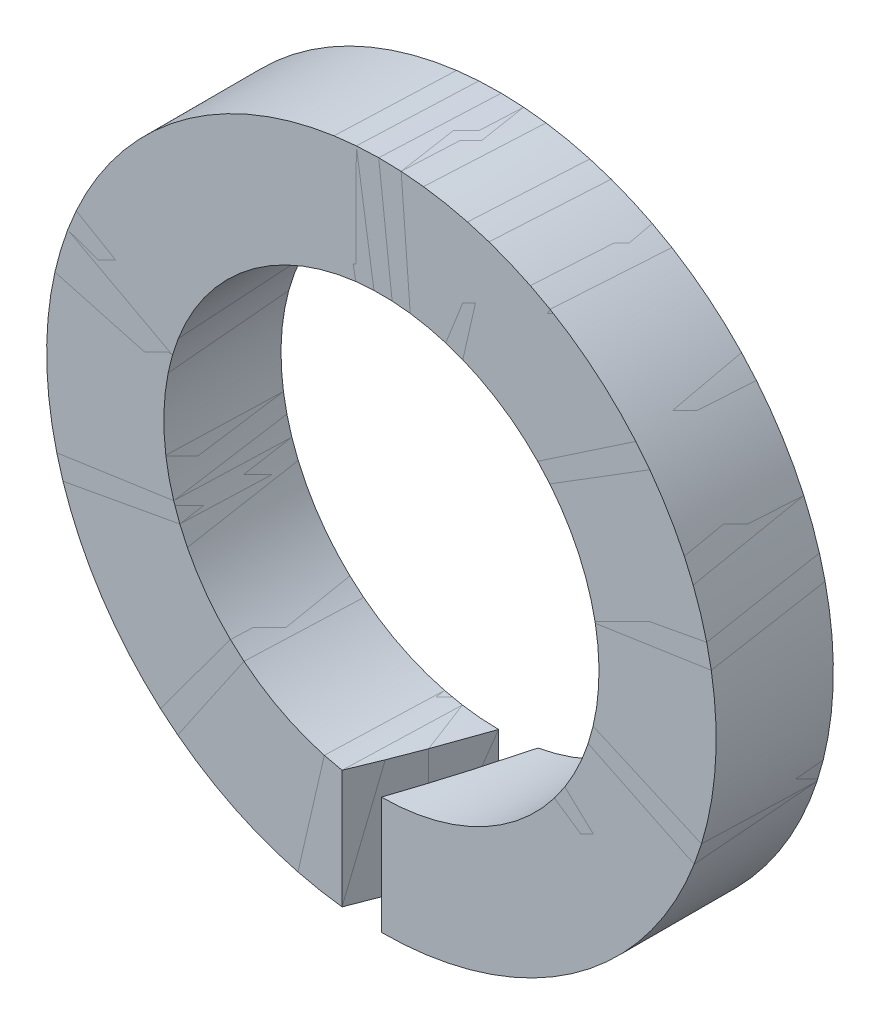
ISO-10303-21;
HEADER;
FILE_DESCRIPTION(('STEP AP214'),'2;1');
FILE_NAME('part.step','',(''),(''),'','','');
FILE_SCHEMA(('AUTOMOTIVE_DESIGN { 1 0 10303 214 1 1 1 1 }'));
ENDSEC;
DATA;
#1=APPLICATION_CONTEXT('core data for automotive mechanical design processes');
#2=APPLICATION_PROTOCOL_DEFINITION('international standard','automotive_design',2000,#1);
#3=PRODUCT_CONTEXT('',#1,'mechanical');
#4=PRODUCT('Part','Part','',(#3));
#5=PRODUCT_RELATED_PRODUCT_CATEGORY('part','',(#4));
#6=PRODUCT_DEFINITION_FORMATION('','',#4);
#7=PRODUCT_DEFINITION_CONTEXT('part definition',#1,'design');
#8=PRODUCT_DEFINITION('design','',#6,#7);
#9=PRODUCT_DEFINITION_SHAPE('','',#8);
#10=(LENGTH_UNIT() NAMED_UNIT(*) SI_UNIT(.MILLI.,.METRE.));
#11=(NAMED_UNIT(*) PLANE_ANGLE_UNIT() SI_UNIT($,.RADIAN.));
#12=(NAMED_UNIT(*) SI_UNIT($,.STERADIAN.) SOLID_ANGLE_UNIT());
#13=UNCERTAINTY_MEASURE_WITH_UNIT(LENGTH_MEASURE(1.E-05),#10,'distance_accuracy_value','');
#14=(GEOMETRIC_REPRESENTATION_CONTEXT(3) GLOBAL_UNCERTAINTY_ASSIGNED_CONTEXT((#13)) GLOBAL_UNIT_ASSIGNED_CONTEXT((#10,
#11,#12)) REPRESENTATION_CONTEXT('',''));
#15=CARTESIAN_POINT('',(0.,0.,0.));
#16=DIRECTION('',(0.,0.,1.));
#17=DIRECTION('',(1.,0.,0.));
#18=AXIS2_PLACEMENT_3D('',#15,#16,#17);
#19=CARTESIAN_POINT('',(0.,0.,0.));
#20=DIRECTION('',(0.,0.,-1.));
#21=DIRECTION('',(0.,1.,0.));
#22=AXIS2_PLACEMENT_3D('',#19,#20,#21);
#23=CYLINDRICAL_SURFACE('',#22,6.5);
#24=CARTESIAN_POINT('',(0.,0.,3.5));
#25=DIRECTION('',(0.,0.,-1.));
#26=DIRECTION('',(0.,1.,0.));
#27=AXIS2_PLACEMENT_3D('',#24,#25,#26);
#28=CIRCLE('',#27,6.5);
#29=CARTESIAN_POINT('',(-1.17647058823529,-6.39264553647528,3.5));
#30=VERTEX_POINT('',#29);
#31=CARTESIAN_POINT('',(0.,-6.5,3.5));
#32=VERTEX_POINT('',#31);
#33=EDGE_CURVE('P0_E11',#30,#32,#28,.T.);
#34=ORIENTED_EDGE('',*,*,#33,.F.);
#35=CARTESIAN_POINT('',(0.,0.,0.));
#36=DIRECTION('',(-0.947883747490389,0.,-0.318616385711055));
#37=DIRECTION('',(0.318616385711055,0.,-0.947883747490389));
#38=AXIS2_PLACEMENT_3D('',#35,#36,#37);
#39=ELLIPSE('',#38,20.4007084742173,6.5);
#40=CARTESIAN_POINT('',(0.,-6.5,0.));
#41=VERTEX_POINT('',#40);
#42=EDGE_CURVE('P0_E88',#30,#41,#39,.F.);
#43=ORIENTED_EDGE('',*,*,#42,.T.);
#44=CARTESIAN_POINT('',(0.,0.,0.));
#45=DIRECTION('',(0.,0.,-1.));
#46=DIRECTION('',(0.,1.,0.));
#47=AXIS2_PLACEMENT_3D('',#44,#45,#46);
#48=CIRCLE('',#47,6.5);
#49=CARTESIAN_POINT('',(1.17647058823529,-6.39264553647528,0.));
#50=VERTEX_POINT('',#49);
#51=EDGE_CURVE('P0_E83',#41,#50,#48,.T.);
#52=ORIENTED_EDGE('',*,*,#51,.T.);
#53=CARTESIAN_POINT('',(0.,0.,3.5));
#54=DIRECTION('',(-0.947883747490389,0.,-0.318616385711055));
#55=DIRECTION('',(0.318616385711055,0.,-0.947883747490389));
#56=AXIS2_PLACEMENT_3D('',#53,#54,#55);
#57=ELLIPSE('',#56,20.4007084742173,6.5);
#58=EDGE_CURVE('P0_E40',#32,#50,#57,.F.);
#59=ORIENTED_EDGE('',*,*,#58,.F.);
#60=EDGE_LOOP('',(#34,#43,#52,#59));
#61=FACE_BOUND('',#60,.T.);
#62=ADVANCED_FACE('P0_F26',(#61),#23,.F.);
#63=CARTESIAN_POINT('',(10.,0.,3.5));
#64=DIRECTION('',(0.,0.,1.));
#65=DIRECTION('',(0.,-1.,0.));
#66=AXIS2_PLACEMENT_3D('',#63,#64,#65);
#67=PLANE('',#66);
#68=DIRECTION('',(0.,1.,0.));
#69=VECTOR('',#68,1.);
#70=CARTESIAN_POINT('',(-1.17647058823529,-10.35,3.5));
#71=LINE('',#70,#69);
#72=CARTESIAN_POINT('',(-1.17647058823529,-9.93055471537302,3.5));
#73=VERTEX_POINT('',#72);
#74=EDGE_CURVE('P0_E73',#73,#30,#71,.T.);
#75=ORIENTED_EDGE('',*,*,#74,.T.);
#76=ORIENTED_EDGE('',*,*,#33,.T.);
#77=DIRECTION('',(0.,1.,0.));
#78=VECTOR('',#77,1.);
#79=CARTESIAN_POINT('',(0.,-10.35,3.5));
#80=LINE('',#79,#78);
#81=CARTESIAN_POINT('',(0.,-10.,3.5));
#82=VERTEX_POINT('',#81);
#83=EDGE_CURVE('P0_E67',#82,#32,#80,.T.);
#84=ORIENTED_EDGE('',*,*,#83,.F.);
#85=CARTESIAN_POINT('',(0.,0.,3.5));
#86=DIRECTION('',(0.,0.,-1.));
#87=DIRECTION('',(0.,1.,0.));
#88=AXIS2_PLACEMENT_3D('',#85,#86,#87);
#89=CIRCLE('',#88,10.);
#90=EDGE_CURVE('P0_E33',#73,#82,#89,.T.);
#91=ORIENTED_EDGE('',*,*,#90,.F.);
#92=EDGE_LOOP('',(#75,#76,#84,#91));
#93=FACE_BOUND('',#92,.T.);
#94=ADVANCED_FACE('P0_F78',(#93),#67,.T.);
#95=CARTESIAN_POINT('',(0.,0.,0.));
#96=DIRECTION('',(0.,0.,-1.));
#97=DIRECTION('',(0.,1.,0.));
#98=AXIS2_PLACEMENT_3D('',#95,#96,#97);
#99=CYLINDRICAL_SURFACE('',#98,10.);
#100=CARTESIAN_POINT('',(0.,0.,0.));
#101=DIRECTION('',(-0.947883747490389,0.,-0.318616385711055));
#102=DIRECTION('',(0.318616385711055,0.,-0.947883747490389));
#103=AXIS2_PLACEMENT_3D('',#100,#101,#102);
#104=ELLIPSE('',#103,31.3857053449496,10.);
#105=CARTESIAN_POINT('',(0.,-10.,0.));
#106=VERTEX_POINT('',#105);
#107=EDGE_CURVE('P0_E48',#73,#106,#104,.F.);
#108=ORIENTED_EDGE('',*,*,#107,.F.);
#109=ORIENTED_EDGE('',*,*,#90,.T.);
#110=CARTESIAN_POINT('',(0.,0.,3.5));
#111=DIRECTION('',(-0.947883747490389,0.,-0.318616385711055));
#112=DIRECTION('',(0.318616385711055,0.,-0.947883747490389));
#113=AXIS2_PLACEMENT_3D('',#110,#111,#112);
#114=ELLIPSE('',#113,31.3857053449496,10.);
#115=CARTESIAN_POINT('',(1.17647058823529,-9.93055471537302,0.));
#116=VERTEX_POINT('',#115);
#117=EDGE_CURVE('P0_E64',#82,#116,#114,.F.);
#118=ORIENTED_EDGE('',*,*,#117,.T.);
#119=CARTESIAN_POINT('',(0.,0.,0.));
#120=DIRECTION('',(0.,0.,-1.));
#121=DIRECTION('',(0.,1.,0.));
#122=AXIS2_PLACEMENT_3D('',#119,#120,#121);
#123=CIRCLE('',#122,10.);
#124=EDGE_CURVE('P0_E82',#106,#116,#123,.T.);
#125=ORIENTED_EDGE('',*,*,#124,.F.);
#126=EDGE_LOOP('',(#108,#109,#118,#125));
#127=FACE_BOUND('',#126,.T.);
#128=ADVANCED_FACE('P0_F81',(#127),#99,.T.);
#129=CARTESIAN_POINT('',(6.5,0.,0.));
#130=DIRECTION('',(0.,0.,-1.));
#131=DIRECTION('',(0.,1.,0.));
#132=AXIS2_PLACEMENT_3D('',#129,#130,#131);
#133=PLANE('',#132);
#134=DIRECTION('',(0.,1.,0.));
#135=VECTOR('',#134,1.);
#136=CARTESIAN_POINT('',(0.,-10.35,0.));
#137=LINE('',#136,#135);
#138=EDGE_CURVE('P0_E93',#106,#41,#137,.T.);
#139=ORIENTED_EDGE('',*,*,#138,.F.);
#140=ORIENTED_EDGE('',*,*,#124,.T.);
#141=DIRECTION('',(0.,1.,0.));
#142=VECTOR('',#141,1.);
#143=CARTESIAN_POINT('',(1.17647058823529,-10.35,0.));
#144=LINE('',#143,#142);
#145=EDGE_CURVE('P0_E68',#116,#50,#144,.T.);
#146=ORIENTED_EDGE('',*,*,#145,.T.);
#147=ORIENTED_EDGE('',*,*,#51,.F.);
#148=EDGE_LOOP('',(#139,#140,#146,#147));
#149=FACE_BOUND('',#148,.T.);
#150=ADVANCED_FACE('P0_F99',(#149),#133,.T.);
#151=CARTESIAN_POINT('',(1.17647058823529,-10.35,0.));
#152=DIRECTION('',(-0.947883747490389,0.,-0.318616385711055));
#153=DIRECTION('',(0.318616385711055,0.,-0.947883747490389));
#154=AXIS2_PLACEMENT_3D('',#151,#152,#153);
#155=PLANE('',#154);
#156=ORIENTED_EDGE('',*,*,#58,.T.);
#157=ORIENTED_EDGE('',*,*,#145,.F.);
#158=ORIENTED_EDGE('',*,*,#117,.F.);
#159=ORIENTED_EDGE('',*,*,#83,.T.);
#160=EDGE_LOOP('',(#156,#157,#158,#159));
#161=FACE_BOUND('',#160,.T.);
#162=ADVANCED_FACE('P0_F66',(#161),#155,.T.);
#163=CARTESIAN_POINT('',(0.,-10.35,0.));
#164=DIRECTION('',(-0.947883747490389,0.,-0.318616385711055));
#165=DIRECTION('',(0.318616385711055,0.,-0.947883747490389));
#166=AXIS2_PLACEMENT_3D('',#163,#164,#165);
#167=PLANE('',#166);
#168=ORIENTED_EDGE('',*,*,#74,.F.);
#169=ORIENTED_EDGE('',*,*,#107,.T.);
#170=ORIENTED_EDGE('',*,*,#138,.T.);
#171=ORIENTED_EDGE('',*,*,#42,.F.);
#172=EDGE_LOOP('',(#168,#169,#170,#171));
#173=FACE_BOUND('',#172,.T.);
#174=ADVANCED_FACE('P0_F100',(#173),#167,.F.);
#175=CLOSED_SHELL('',(#62,#94,#128,#150,#162,#174));
#176=MANIFOLD_SOLID_BREP('P0_B2',#175);
#177=CARTESIAN_POINT('',(0.,0.,0.));
#178=DIRECTION('',(0.,0.,-1.));
#179=DIRECTION('',(0.,1.,0.));
#180=AXIS2_PLACEMENT_3D('',#177,#178,#179);
#181=CYLINDRICAL_SURFACE('',#180,6.5);
#182=CARTESIAN_POINT('',(0.,0.,3.5));
#183=DIRECTION('',(0.,0.,-1.));
#184=DIRECTION('',(0.,1.,0.));
#185=AXIS2_PLACEMENT_3D('',#182,#183,#184);
#186=CIRCLE('',#185,6.5);
#187=CARTESIAN_POINT('',(-1.17647058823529,-6.39264553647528,3.5));
#188=VERTEX_POINT('',#187);
#189=CARTESIAN_POINT('',(0.,-6.5,3.5));
#190=VERTEX_POINT('',#189);
#191=EDGE_CURVE('P1_E11',#188,#190,#186,.T.);
#192=ORIENTED_EDGE('',*,*,#191,.F.);
#193=CARTESIAN_POINT('',(0.,0.,0.));
#194=DIRECTION('',(-0.947883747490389,0.,-0.318616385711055));
#195=DIRECTION('',(0.318616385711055,0.,-0.947883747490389));
#196=AXIS2_PLACEMENT_3D('',#193,#194,#195);
#197=ELLIPSE('',#196,20.4007084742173,6.5);
#198=CARTESIAN_POINT('',(0.,-6.5,0.));
#199=VERTEX_POINT('',#198);
#200=EDGE_CURVE('P1_E78',#188,#199,#197,.F.);
#201=ORIENTED_EDGE('',*,*,#200,.T.);
#202=CARTESIAN_POINT('',(0.,0.,0.));
#203=DIRECTION('',(0.,0.,-1.));
#204=DIRECTION('',(0.,1.,0.));
#205=AXIS2_PLACEMENT_3D('',#202,#203,#204);
#206=CIRCLE('',#205,6.5);
#207=CARTESIAN_POINT('',(1.17647058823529,-6.39264553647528,0.));
#208=VERTEX_POINT('',#207);
#209=EDGE_CURVE('P1_E73',#199,#208,#206,.T.);
#210=ORIENTED_EDGE('',*,*,#209,.T.);
#211=CARTESIAN_POINT('',(0.,0.,3.5));
#212=DIRECTION('',(-0.947883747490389,0.,-0.318616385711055));
#213=DIRECTION('',(0.318616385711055,0.,-0.947883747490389));
#214=AXIS2_PLACEMENT_3D('',#211,#212,#213);
#215=ELLIPSE('',#214,20.4007084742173,6.5);
#216=EDGE_CURVE('P1_E30',#190,#208,#215,.F.);
#217=ORIENTED_EDGE('',*,*,#216,.F.);
#218=EDGE_LOOP('',(#192,#201,#210,#217));
#219=FACE_BOUND('',#218,.T.);
#220=ADVANCED_FACE('P1_F16',(#219),#181,.F.);
#221=CARTESIAN_POINT('',(10.,0.,3.5));
#222=DIRECTION('',(0.,0.,1.));
#223=DIRECTION('',(0.,-1.,0.));
#224=AXIS2_PLACEMENT_3D('',#221,#222,#223);
#225=PLANE('',#224);
#226=DIRECTION('',(0.,1.,0.));
#227=VECTOR('',#226,1.);
#228=CARTESIAN_POINT('',(-1.17647058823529,-10.35,3.5));
#229=LINE('',#228,#227);
#230=CARTESIAN_POINT('',(-1.17647058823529,-9.93055471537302,3.5));
#231=VERTEX_POINT('',#230);
#232=EDGE_CURVE('P1_E63',#231,#188,#229,.T.);
#233=ORIENTED_EDGE('',*,*,#232,.T.);
#234=ORIENTED_EDGE('',*,*,#191,.T.);
#235=DIRECTION('',(0.,1.,0.));
#236=VECTOR('',#235,1.);
#237=CARTESIAN_POINT('',(0.,-10.35,3.5));
#238=LINE('',#237,#236);
#239=CARTESIAN_POINT('',(0.,-10.,3.5));
#240=VERTEX_POINT('',#239);
#241=EDGE_CURVE('P1_E57',#240,#190,#238,.T.);
#242=ORIENTED_EDGE('',*,*,#241,.F.);
#243=CARTESIAN_POINT('',(0.,0.,3.5));
#244=DIRECTION('',(0.,0.,-1.));
#245=DIRECTION('',(0.,1.,0.));
#246=AXIS2_PLACEMENT_3D('',#243,#244,#245);
#247=CIRCLE('',#246,10.);
#248=EDGE_CURVE('P1_E23',#231,#240,#247,.T.);
#249=ORIENTED_EDGE('',*,*,#248,.F.);
#250=EDGE_LOOP('',(#233,#234,#242,#249));
#251=FACE_BOUND('',#250,.T.);
#252=ADVANCED_FACE('P1_F68',(#251),#225,.T.);
#253=CARTESIAN_POINT('',(0.,0.,0.));
#254=DIRECTION('',(0.,0.,-1.));
#255=DIRECTION('',(0.,1.,0.));
#256=AXIS2_PLACEMENT_3D('',#253,#254,#255);
#257=CYLINDRICAL_SURFACE('',#256,10.);
#258=CARTESIAN_POINT('',(0.,0.,0.));
#259=DIRECTION('',(-0.947883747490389,0.,-0.318616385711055));
#260=DIRECTION('',(0.318616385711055,0.,-0.947883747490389));
#261=AXIS2_PLACEMENT_3D('',#258,#259,#260);
#262=ELLIPSE('',#261,31.3857053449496,10.);
#263=CARTESIAN_POINT('',(0.,-10.,0.));
#264=VERTEX_POINT('',#263);
#265=EDGE_CURVE('P1_E38',#231,#264,#262,.F.);
#266=ORIENTED_EDGE('',*,*,#265,.F.);
#267=ORIENTED_EDGE('',*,*,#248,.T.);
#268=CARTESIAN_POINT('',(0.,0.,3.5));
#269=DIRECTION('',(-0.947883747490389,0.,-0.318616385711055));
#270=DIRECTION('',(0.318616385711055,0.,-0.947883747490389));
#271=AXIS2_PLACEMENT_3D('',#268,#269,#270);
#272=ELLIPSE('',#271,31.3857053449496,10.);
#273=CARTESIAN_POINT('',(1.17647058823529,-9.93055471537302,0.));
#274=VERTEX_POINT('',#273);
#275=EDGE_CURVE('P1_E54',#240,#274,#272,.F.);
#276=ORIENTED_EDGE('',*,*,#275,.T.);
#277=CARTESIAN_POINT('',(0.,0.,0.));
#278=DIRECTION('',(0.,0.,-1.));
#279=DIRECTION('',(0.,1.,0.));
#280=AXIS2_PLACEMENT_3D('',#277,#278,#279);
#281=CIRCLE('',#280,10.);
#282=EDGE_CURVE('P1_E72',#264,#274,#281,.T.);
#283=ORIENTED_EDGE('',*,*,#282,.F.);
#284=EDGE_LOOP('',(#266,#267,#276,#283));
#285=FACE_BOUND('',#284,.T.);
#286=ADVANCED_FACE('P1_F71',(#285),#257,.T.);
#287=CARTESIAN_POINT('',(6.5,0.,0.));
#288=DIRECTION('',(0.,0.,-1.));
#289=DIRECTION('',(0.,1.,0.));
#290=AXIS2_PLACEMENT_3D('',#287,#288,#289);
#291=PLANE('',#290);
#292=DIRECTION('',(0.,1.,0.));
#293=VECTOR('',#292,1.);
#294=CARTESIAN_POINT('',(0.,-10.35,0.));
#295=LINE('',#294,#293);
#296=EDGE_CURVE('P1_E83',#264,#199,#295,.T.);
#297=ORIENTED_EDGE('',*,*,#296,.F.);
#298=ORIENTED_EDGE('',*,*,#282,.T.);
#299=DIRECTION('',(0.,1.,0.));
#300=VECTOR('',#299,1.);
#301=CARTESIAN_POINT('',(1.17647058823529,-10.35,0.));
#302=LINE('',#301,#300);
#303=EDGE_CURVE('P1_E58',#274,#208,#302,.T.);
#304=ORIENTED_EDGE('',*,*,#303,.T.);
#305=ORIENTED_EDGE('',*,*,#209,.F.);
#306=EDGE_LOOP('',(#297,#298,#304,#305));
#307=FACE_BOUND('',#306,.T.);
#308=ADVANCED_FACE('P1_F89',(#307),#291,.T.);
#309=CARTESIAN_POINT('',(1.17647058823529,-10.35,0.));
#310=DIRECTION('',(-0.947883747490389,0.,-0.318616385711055));
#311=DIRECTION('',(0.318616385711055,0.,-0.947883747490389));
#312=AXIS2_PLACEMENT_3D('',#309,#310,#311);
#313=PLANE('',#312);
#314=ORIENTED_EDGE('',*,*,#216,.T.);
#315=ORIENTED_EDGE('',*,*,#303,.F.);
#316=ORIENTED_EDGE('',*,*,#275,.F.);
#317=ORIENTED_EDGE('',*,*,#241,.T.);
#318=EDGE_LOOP('',(#314,#315,#316,#317));
#319=FACE_BOUND('',#318,.T.);
#320=ADVANCED_FACE('P1_F56',(#319),#313,.T.);
#321=CARTESIAN_POINT('',(0.,-10.35,0.));
#322=DIRECTION('',(-0.947883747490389,0.,-0.318616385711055));
#323=DIRECTION('',(0.318616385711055,0.,-0.947883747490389));
#324=AXIS2_PLACEMENT_3D('',#321,#322,#323);
#325=PLANE('',#324);
#326=ORIENTED_EDGE('',*,*,#232,.F.);
#327=ORIENTED_EDGE('',*,*,#265,.T.);
#328=ORIENTED_EDGE('',*,*,#296,.T.);
#329=ORIENTED_EDGE('',*,*,#200,.F.);
#330=EDGE_LOOP('',(#326,#327,#328,#329));
#331=FACE_BOUND('',#330,.T.);
#332=ADVANCED_FACE('P1_F90',(#331),#325,.F.);
#333=CLOSED_SHELL('',(#220,#252,#286,#308,#320,#332));
#334=MANIFOLD_SOLID_BREP('P1_B1',#333);
#335=ADVANCED_BREP_SHAPE_REPRESENTATION('',(#18,#176,#334),#14);
#336=SHAPE_DEFINITION_REPRESENTATION(#9,#335);
ENDSEC;
END-ISO-10303-21;
